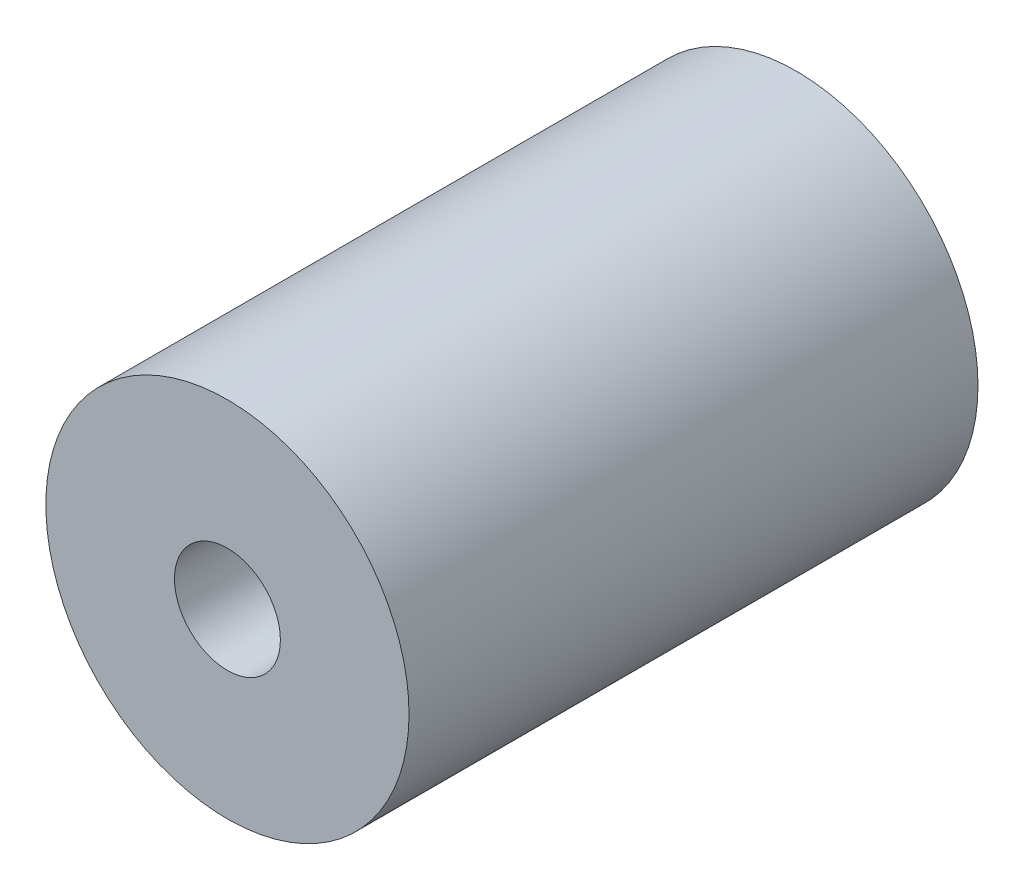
from build123d import *

# Parameters (mm, degrees)
ESQUISSE1_R        = 6
ESQUISSE1_R_2      = 1.75
BOSS_EXTRU_1_DEPTH = 18.8


with BuildPart() as part:
    # Esquisse1 → Boss.-Extru.1 (new body)
    with BuildSketch(Plane.XY):
        Circle(ESQUISSE1_R)
        Circle(ESQUISSE1_R_2, mode=Mode.SUBTRACT)
    extrude(amount=BOSS_EXTRU_1_DEPTH)


solid = part.part
